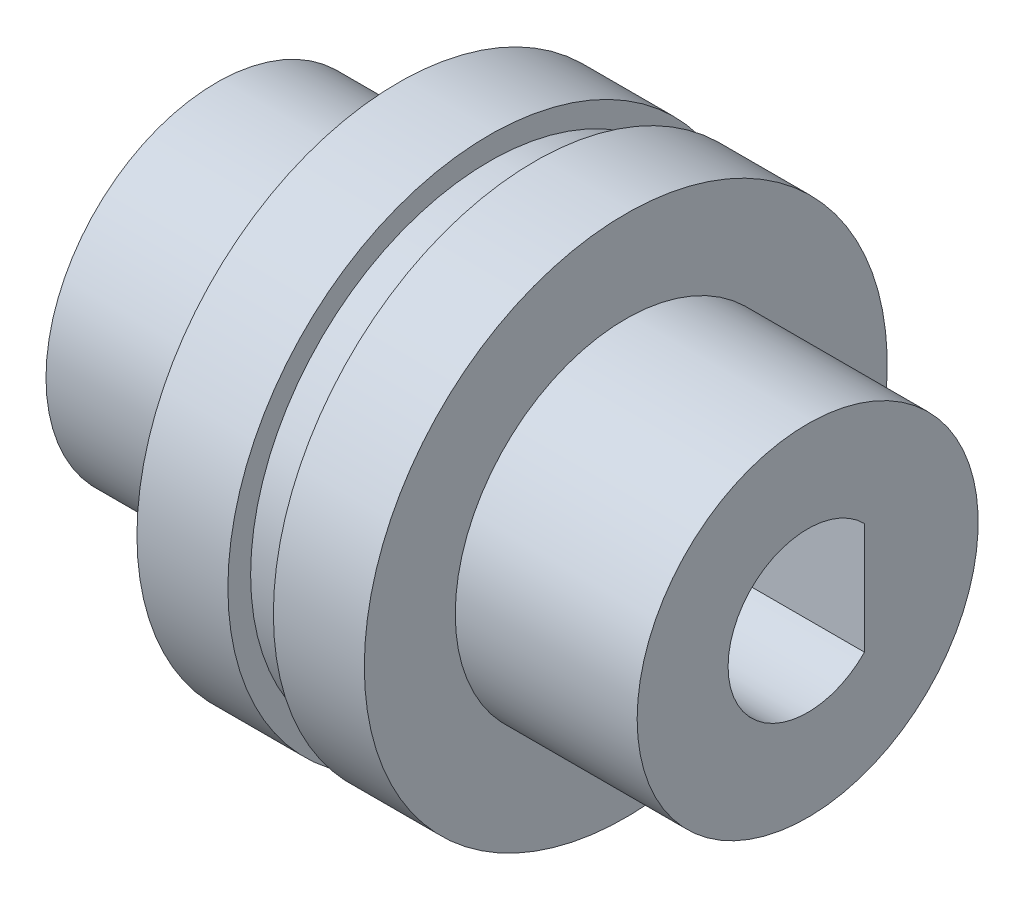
ISO-10303-21;
HEADER;
FILE_DESCRIPTION(('STEP AP214'),'2;1');
FILE_NAME('part.step','',(''),(''),'','','');
FILE_SCHEMA(('AUTOMOTIVE_DESIGN { 1 0 10303 214 1 1 1 1 }'));
ENDSEC;
DATA;
#1=APPLICATION_CONTEXT('core data for automotive mechanical design processes');
#2=APPLICATION_PROTOCOL_DEFINITION('international standard','automotive_design',2000,#1);
#3=PRODUCT_CONTEXT('',#1,'mechanical');
#4=PRODUCT('Part','Part','',(#3));
#5=PRODUCT_RELATED_PRODUCT_CATEGORY('part','',(#4));
#6=PRODUCT_DEFINITION_FORMATION('','',#4);
#7=PRODUCT_DEFINITION_CONTEXT('part definition',#1,'design');
#8=PRODUCT_DEFINITION('design','',#6,#7);
#9=PRODUCT_DEFINITION_SHAPE('','',#8);
#10=(LENGTH_UNIT() NAMED_UNIT(*) SI_UNIT(.MILLI.,.METRE.));
#11=(NAMED_UNIT(*) PLANE_ANGLE_UNIT() SI_UNIT($,.RADIAN.));
#12=(NAMED_UNIT(*) SI_UNIT($,.STERADIAN.) SOLID_ANGLE_UNIT());
#13=UNCERTAINTY_MEASURE_WITH_UNIT(LENGTH_MEASURE(1.E-05),#10,'distance_accuracy_value','');
#14=(GEOMETRIC_REPRESENTATION_CONTEXT(3) GLOBAL_UNCERTAINTY_ASSIGNED_CONTEXT((#13)) GLOBAL_UNIT_ASSIGNED_CONTEXT((#10,
#11,#12)) REPRESENTATION_CONTEXT('',''));
#15=CARTESIAN_POINT('',(0.,0.,0.));
#16=DIRECTION('',(0.,0.,1.));
#17=DIRECTION('',(1.,0.,0.));
#18=AXIS2_PLACEMENT_3D('',#15,#16,#17);
#19=CARTESIAN_POINT('',(0.,0.,0.));
#20=DIRECTION('',(-1.,0.,0.));
#21=DIRECTION('',(0.,0.,1.));
#22=AXIS2_PLACEMENT_3D('',#19,#20,#21);
#23=CYLINDRICAL_SURFACE('',#22,11.1125);
#24=DIRECTION('',(-1.,0.,0.));
#25=VECTOR('',#24,1.);
#26=CARTESIAN_POINT('',(82.55,-7.77712993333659,-7.9375));
#27=LINE('',#26,#25);
#28=CARTESIAN_POINT('',(82.55,-7.7771299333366,-7.9375));
#29=VERTEX_POINT('',#28);
#30=CARTESIAN_POINT('',(0.,-7.77712993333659,-7.9375));
#31=VERTEX_POINT('',#30);
#32=EDGE_CURVE('E44',#29,#31,#27,.T.);
#33=ORIENTED_EDGE('',*,*,#32,.T.);
#34=CARTESIAN_POINT('',(0.,0.,0.));
#35=DIRECTION('',(-1.,0.,0.));
#36=DIRECTION('',(0.,0.,1.));
#37=AXIS2_PLACEMENT_3D('',#34,#35,#36);
#38=CIRCLE('',#37,11.1125);
#39=CARTESIAN_POINT('',(0.,7.77712993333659,-7.9375));
#40=VERTEX_POINT('',#39);
#41=EDGE_CURVE('E37',#31,#40,#38,.T.);
#42=ORIENTED_EDGE('',*,*,#41,.T.);
#43=DIRECTION('',(-1.,0.,0.));
#44=VECTOR('',#43,1.);
#45=CARTESIAN_POINT('',(82.55,7.77712993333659,-7.9375));
#46=LINE('',#45,#44);
#47=CARTESIAN_POINT('',(82.55,7.77712993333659,-7.9375));
#48=VERTEX_POINT('',#47);
#49=EDGE_CURVE('E60',#48,#40,#46,.T.);
#50=ORIENTED_EDGE('',*,*,#49,.F.);
#51=CARTESIAN_POINT('',(82.55,0.,0.));
#52=DIRECTION('',(-1.,0.,0.));
#53=DIRECTION('',(0.,0.,1.));
#54=AXIS2_PLACEMENT_3D('',#51,#52,#53);
#55=CIRCLE('',#54,11.1125);
#56=EDGE_CURVE('E67',#29,#48,#55,.T.);
#57=ORIENTED_EDGE('',*,*,#56,.F.);
#58=EDGE_LOOP('',(#33,#42,#50,#57));
#59=FACE_BOUND('',#58,.T.);
#60=ADVANCED_FACE('F29',(#59),#23,.F.);
#61=CARTESIAN_POINT('',(0.,0.,0.));
#62=DIRECTION('',(-1.,0.,0.));
#63=DIRECTION('',(0.,0.,1.));
#64=AXIS2_PLACEMENT_3D('',#61,#62,#63);
#65=CYLINDRICAL_SURFACE('',#64,23.8125);
#66=CARTESIAN_POINT('',(25.4,0.,0.));
#67=DIRECTION('',(-1.,0.,0.));
#68=DIRECTION('',(0.,0.,1.));
#69=AXIS2_PLACEMENT_3D('',#66,#67,#68);
#70=CIRCLE('',#69,23.8125);
#71=CARTESIAN_POINT('',(25.4,0.,23.8125));
#72=VERTEX_POINT('',#71);
#73=EDGE_CURVE('E65',#72,#72,#70,.T.);
#74=ORIENTED_EDGE('',*,*,#73,.T.);
#75=EDGE_LOOP('',(#74));
#76=FACE_BOUND('',#75,.T.);
#77=CARTESIAN_POINT('',(0.,0.,0.));
#78=DIRECTION('',(-1.,0.,0.));
#79=DIRECTION('',(0.,0.,1.));
#80=AXIS2_PLACEMENT_3D('',#77,#78,#79);
#81=CIRCLE('',#80,23.8125);
#82=CARTESIAN_POINT('',(0.,0.,23.8125));
#83=VERTEX_POINT('',#82);
#84=EDGE_CURVE('E11',#83,#83,#81,.T.);
#85=ORIENTED_EDGE('',*,*,#84,.F.);
#86=EDGE_LOOP('',(#85));
#87=FACE_BOUND('',#86,.T.);
#88=ADVANCED_FACE('F31',(#76,#87),#65,.T.);
#89=CARTESIAN_POINT('',(0.,11.1125,0.));
#90=DIRECTION('',(-1.,0.,0.));
#91=DIRECTION('',(0.,0.,1.));
#92=AXIS2_PLACEMENT_3D('',#89,#90,#91);
#93=PLANE('',#92);
#94=ORIENTED_EDGE('',*,*,#84,.T.);
#95=EDGE_LOOP('',(#94));
#96=FACE_BOUND('',#95,.T.);
#97=ORIENTED_EDGE('',*,*,#41,.F.);
#98=DIRECTION('',(0.,-1.,0.));
#99=VECTOR('',#98,1.);
#100=CARTESIAN_POINT('',(0.,7.77712993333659,-7.9375));
#101=LINE('',#100,#99);
#102=EDGE_CURVE('E56',#40,#31,#101,.T.);
#103=ORIENTED_EDGE('',*,*,#102,.F.);
#104=EDGE_LOOP('',(#97,#103));
#105=FACE_BOUND('',#104,.T.);
#106=ADVANCED_FACE('F57',(#96,#105),#93,.T.);
#107=CARTESIAN_POINT('',(82.55,11.1125,0.));
#108=DIRECTION('',(-1.,0.,0.));
#109=DIRECTION('',(0.,0.,1.));
#110=AXIS2_PLACEMENT_3D('',#107,#108,#109);
#111=PLANE('',#110);
#112=CARTESIAN_POINT('',(82.55,0.,0.));
#113=DIRECTION('',(-1.,0.,0.));
#114=DIRECTION('',(0.,0.,1.));
#115=AXIS2_PLACEMENT_3D('',#112,#113,#114);
#116=CIRCLE('',#115,23.8125);
#117=CARTESIAN_POINT('',(82.55,0.,23.8125));
#118=VERTEX_POINT('',#117);
#119=EDGE_CURVE('E68',#118,#118,#116,.T.);
#120=ORIENTED_EDGE('',*,*,#119,.F.);
#121=EDGE_LOOP('',(#120));
#122=FACE_BOUND('',#121,.T.);
#123=ORIENTED_EDGE('',*,*,#56,.T.);
#124=DIRECTION('',(0.,-1.,0.));
#125=VECTOR('',#124,1.);
#126=CARTESIAN_POINT('',(82.55,7.77712993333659,-7.9375));
#127=LINE('',#126,#125);
#128=EDGE_CURVE('E48',#48,#29,#127,.T.);
#129=ORIENTED_EDGE('',*,*,#128,.T.);
#130=EDGE_LOOP('',(#123,#129));
#131=FACE_BOUND('',#130,.T.);
#132=ADVANCED_FACE('F98',(#122,#131),#111,.F.);
#133=CARTESIAN_POINT('',(0.,0.,0.));
#134=DIRECTION('',(-1.,0.,0.));
#135=DIRECTION('',(0.,0.,1.));
#136=AXIS2_PLACEMENT_3D('',#133,#134,#135);
#137=CYLINDRICAL_SURFACE('',#136,23.8125);
#138=CARTESIAN_POINT('',(57.15,0.,0.));
#139=DIRECTION('',(-1.,0.,0.));
#140=DIRECTION('',(0.,0.,1.));
#141=AXIS2_PLACEMENT_3D('',#138,#139,#140);
#142=CIRCLE('',#141,23.8125);
#143=CARTESIAN_POINT('',(57.15,0.,23.8125));
#144=VERTEX_POINT('',#143);
#145=EDGE_CURVE('E73',#144,#144,#142,.T.);
#146=ORIENTED_EDGE('',*,*,#145,.F.);
#147=EDGE_LOOP('',(#146));
#148=FACE_BOUND('',#147,.T.);
#149=ORIENTED_EDGE('',*,*,#119,.T.);
#150=EDGE_LOOP('',(#149));
#151=FACE_BOUND('',#150,.T.);
#152=ADVANCED_FACE('F100',(#148,#151),#137,.T.);
#153=CARTESIAN_POINT('',(57.15,23.8125,0.));
#154=DIRECTION('',(-1.,0.,0.));
#155=DIRECTION('',(0.,0.,1.));
#156=AXIS2_PLACEMENT_3D('',#153,#154,#155);
#157=PLANE('',#156);
#158=CARTESIAN_POINT('',(57.15,0.,0.));
#159=DIRECTION('',(-1.,0.,0.));
#160=DIRECTION('',(0.,0.,1.));
#161=AXIS2_PLACEMENT_3D('',#158,#159,#160);
#162=CIRCLE('',#161,36.5125);
#163=CARTESIAN_POINT('',(57.15,0.,36.5125));
#164=VERTEX_POINT('',#163);
#165=EDGE_CURVE('E76',#164,#164,#162,.T.);
#166=ORIENTED_EDGE('',*,*,#165,.F.);
#167=EDGE_LOOP('',(#166));
#168=FACE_BOUND('',#167,.T.);
#169=ORIENTED_EDGE('',*,*,#145,.T.);
#170=EDGE_LOOP('',(#169));
#171=FACE_BOUND('',#170,.T.);
#172=ADVANCED_FACE('F108',(#168,#171),#157,.F.);
#173=CARTESIAN_POINT('',(0.,0.,0.));
#174=DIRECTION('',(-1.,0.,0.));
#175=DIRECTION('',(0.,0.,1.));
#176=AXIS2_PLACEMENT_3D('',#173,#174,#175);
#177=CYLINDRICAL_SURFACE('',#176,36.5125);
#178=CARTESIAN_POINT('',(44.45,0.,0.));
#179=DIRECTION('',(-1.,0.,0.));
#180=DIRECTION('',(0.,0.,1.));
#181=AXIS2_PLACEMENT_3D('',#178,#179,#180);
#182=CIRCLE('',#181,36.5125);
#183=CARTESIAN_POINT('',(44.45,0.,36.5125));
#184=VERTEX_POINT('',#183);
#185=EDGE_CURVE('E79',#184,#184,#182,.T.);
#186=ORIENTED_EDGE('',*,*,#185,.F.);
#187=EDGE_LOOP('',(#186));
#188=FACE_BOUND('',#187,.T.);
#189=ORIENTED_EDGE('',*,*,#165,.T.);
#190=EDGE_LOOP('',(#189));
#191=FACE_BOUND('',#190,.T.);
#192=ADVANCED_FACE('F148',(#188,#191),#177,.T.);
#193=CARTESIAN_POINT('',(44.45,36.5125,0.));
#194=DIRECTION('',(1.,0.,0.));
#195=DIRECTION('',(0.,0.,-1.));
#196=AXIS2_PLACEMENT_3D('',#193,#194,#195);
#197=PLANE('',#196);
#198=CARTESIAN_POINT('',(44.45,0.,0.));
#199=DIRECTION('',(-1.,0.,0.));
#200=DIRECTION('',(0.,0.,1.));
#201=AXIS2_PLACEMENT_3D('',#198,#199,#200);
#202=CIRCLE('',#201,33.3375);
#203=CARTESIAN_POINT('',(44.45,0.,33.3375));
#204=VERTEX_POINT('',#203);
#205=EDGE_CURVE('E82',#204,#204,#202,.T.);
#206=ORIENTED_EDGE('',*,*,#205,.F.);
#207=EDGE_LOOP('',(#206));
#208=FACE_BOUND('',#207,.T.);
#209=ORIENTED_EDGE('',*,*,#185,.T.);
#210=EDGE_LOOP('',(#209));
#211=FACE_BOUND('',#210,.T.);
#212=ADVANCED_FACE('F144',(#208,#211),#197,.F.);
#213=CARTESIAN_POINT('',(0.,0.,0.));
#214=DIRECTION('',(-1.,0.,0.));
#215=DIRECTION('',(0.,0.,1.));
#216=AXIS2_PLACEMENT_3D('',#213,#214,#215);
#217=CYLINDRICAL_SURFACE('',#216,33.3375);
#218=ORIENTED_EDGE('',*,*,#205,.T.);
#219=EDGE_LOOP('',(#218));
#220=FACE_BOUND('',#219,.T.);
#221=CARTESIAN_POINT('',(38.1,0.,0.));
#222=DIRECTION('',(-1.,0.,0.));
#223=DIRECTION('',(0.,0.,1.));
#224=AXIS2_PLACEMENT_3D('',#221,#222,#223);
#225=CIRCLE('',#224,33.3375);
#226=CARTESIAN_POINT('',(38.1,0.,33.3375));
#227=VERTEX_POINT('',#226);
#228=EDGE_CURVE('E85',#227,#227,#225,.T.);
#229=ORIENTED_EDGE('',*,*,#228,.F.);
#230=EDGE_LOOP('',(#229));
#231=FACE_BOUND('',#230,.T.);
#232=ADVANCED_FACE('F140',(#220,#231),#217,.T.);
#233=CARTESIAN_POINT('',(38.1,36.5125,0.));
#234=DIRECTION('',(1.,0.,0.));
#235=DIRECTION('',(0.,0.,-1.));
#236=AXIS2_PLACEMENT_3D('',#233,#234,#235);
#237=PLANE('',#236);
#238=ORIENTED_EDGE('',*,*,#228,.T.);
#239=EDGE_LOOP('',(#238));
#240=FACE_BOUND('',#239,.T.);
#241=CARTESIAN_POINT('',(38.1,0.,0.));
#242=DIRECTION('',(-1.,0.,0.));
#243=DIRECTION('',(0.,0.,1.));
#244=AXIS2_PLACEMENT_3D('',#241,#242,#243);
#245=CIRCLE('',#244,36.5125);
#246=CARTESIAN_POINT('',(38.1,0.,36.5125));
#247=VERTEX_POINT('',#246);
#248=EDGE_CURVE('E88',#247,#247,#245,.T.);
#249=ORIENTED_EDGE('',*,*,#248,.F.);
#250=EDGE_LOOP('',(#249));
#251=FACE_BOUND('',#250,.T.);
#252=ADVANCED_FACE('F134',(#240,#251),#237,.T.);
#253=CARTESIAN_POINT('',(0.,0.,0.));
#254=DIRECTION('',(-1.,0.,0.));
#255=DIRECTION('',(0.,0.,1.));
#256=AXIS2_PLACEMENT_3D('',#253,#254,#255);
#257=CYLINDRICAL_SURFACE('',#256,36.5125);
#258=ORIENTED_EDGE('',*,*,#248,.T.);
#259=EDGE_LOOP('',(#258));
#260=FACE_BOUND('',#259,.T.);
#261=CARTESIAN_POINT('',(25.4,0.,0.));
#262=DIRECTION('',(-1.,0.,0.));
#263=DIRECTION('',(0.,0.,1.));
#264=AXIS2_PLACEMENT_3D('',#261,#262,#263);
#265=CIRCLE('',#264,36.5125);
#266=CARTESIAN_POINT('',(25.4,0.,36.5125));
#267=VERTEX_POINT('',#266);
#268=EDGE_CURVE('E91',#267,#267,#265,.T.);
#269=ORIENTED_EDGE('',*,*,#268,.F.);
#270=EDGE_LOOP('',(#269));
#271=FACE_BOUND('',#270,.T.);
#272=ADVANCED_FACE('F127',(#260,#271),#257,.T.);
#273=CARTESIAN_POINT('',(25.4,23.8125,0.));
#274=DIRECTION('',(-1.,0.,0.));
#275=DIRECTION('',(0.,0.,1.));
#276=AXIS2_PLACEMENT_3D('',#273,#274,#275);
#277=PLANE('',#276);
#278=ORIENTED_EDGE('',*,*,#268,.T.);
#279=EDGE_LOOP('',(#278));
#280=FACE_BOUND('',#279,.T.);
#281=ORIENTED_EDGE('',*,*,#73,.F.);
#282=EDGE_LOOP('',(#281));
#283=FACE_BOUND('',#282,.T.);
#284=ADVANCED_FACE('F126',(#280,#283),#277,.T.);
#285=CARTESIAN_POINT('',(82.55,7.77712993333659,-7.9375));
#286=DIRECTION('',(0.,0.,-1.));
#287=DIRECTION('',(-1.,0.,0.));
#288=AXIS2_PLACEMENT_3D('',#285,#286,#287);
#289=PLANE('',#288);
#290=ORIENTED_EDGE('',*,*,#102,.T.);
#291=ORIENTED_EDGE('',*,*,#32,.F.);
#292=ORIENTED_EDGE('',*,*,#128,.F.);
#293=ORIENTED_EDGE('',*,*,#49,.T.);
#294=EDGE_LOOP('',(#290,#291,#292,#293));
#295=FACE_BOUND('',#294,.T.);
#296=ADVANCED_FACE('F61',(#295),#289,.F.);
#297=CLOSED_SHELL('',(#60,#88,#106,#132,#152,#172,#192,#212,#232,#252,#272,#284,#296));
#298=MANIFOLD_SOLID_BREP('B2',#297);
#299=ADVANCED_BREP_SHAPE_REPRESENTATION('',(#18,#298),#14);
#300=SHAPE_DEFINITION_REPRESENTATION(#9,#299);
ENDSEC;
END-ISO-10303-21;
